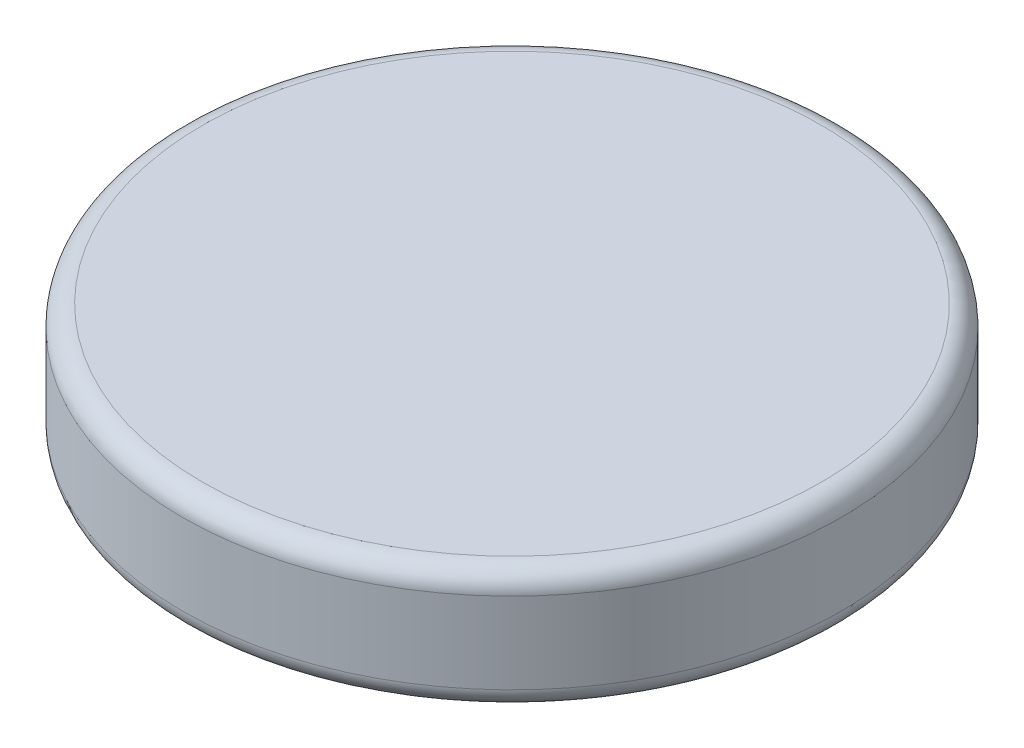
from build123d import *

# Parameters (mm, degrees)
SKETCH1_R           = 32.5
BOSS_EXTRUDE1_DEPTH = 12
FILLET1_R           = 2


with BuildPart() as part:
    # Sketch1 → Boss-Extrude1 (new body)
    with BuildSketch(Plane(origin=(0, 0, 0), x_dir=(1, 0, 0), z_dir=(0, 1, 0))):
        with Locations(Location((0, 0, 0), (0, 0, 270))):
            Circle(SKETCH1_R)
    extrude(amount=BOSS_EXTRUDE1_DEPTH)

    # Fillet1
    fillet1_edges = [part.edges().sort_by_distance(p)[0] for p in [
        (0, 0, -32.5),
        (0, 12, -32.5),
    ]]
    fillet(fillet1_edges, radius=FILLET1_R)


solid = part.part
